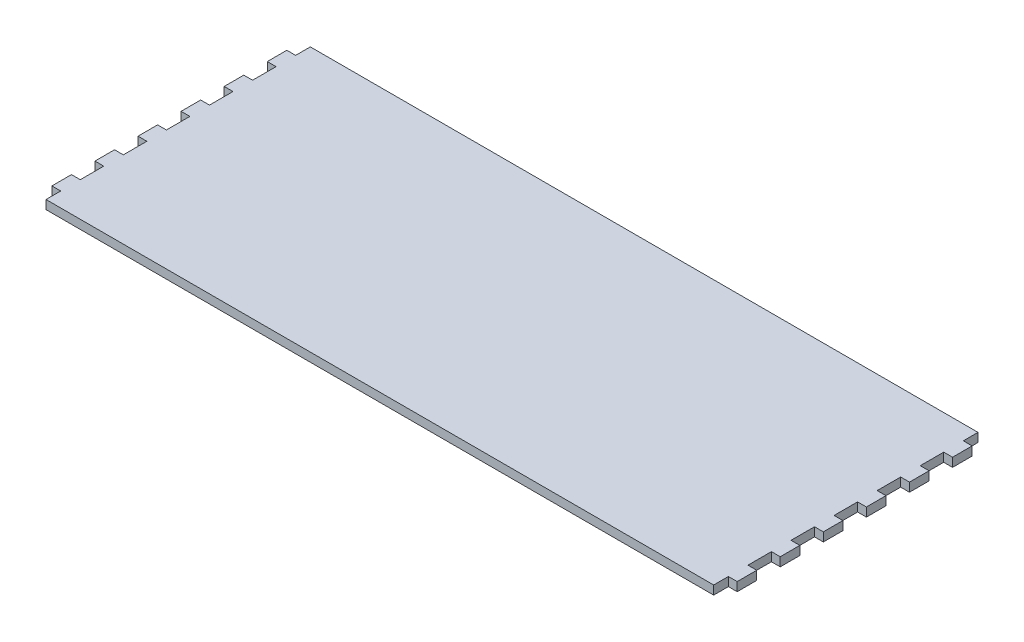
from build123d import *

# Parameters (mm, degrees)
SKETCH1_W           = 682
SKETCH1_H           = 270
BOSS_EXTRUDE1_DEPTH = 9
SKETCH3_W           = 9
SKETCH3_H           = 20
BOSS_EXTRUDE2_DEPTH = 9


with BuildPart() as part:
    # Sketch1 → Boss-Extrude1 (new body)
    with BuildSketch(Plane(origin=(0, 0, 0), x_dir=(1, 0, 0), z_dir=(0, 1, 0))):
        Rectangle(SKETCH1_W, SKETCH1_H)
    extrude(amount=BOSS_EXTRUDE1_DEPTH)

    # Sketch3 → Boss-Extrude2 (add)
    with BuildSketch(Plane(origin=(0, 9, 0), x_dir=(1, 0, 0), z_dir=(0, 1, 0))):
        with Locations((-345.5, -110)):
            Rectangle(SKETCH3_W, SKETCH3_H)
        with Locations((-345.5, -66)):
            Rectangle(SKETCH3_W, SKETCH3_H)
        with Locations((-345.5, -22)):
            Rectangle(SKETCH3_W, SKETCH3_H)
        with Locations((-345.5, 22)):
            Rectangle(SKETCH3_W, SKETCH3_H)
        with Locations((-345.5, 66)):
            Rectangle(SKETCH3_W, SKETCH3_H)
        with Locations((-345.5, 110)):
            Rectangle(SKETCH3_W, SKETCH3_H)
        with Locations((345.5, -110)):
            Rectangle(SKETCH3_W, SKETCH3_H)
        with Locations((345.5, -66)):
            Rectangle(SKETCH3_W, SKETCH3_H)
        with Locations((345.5, -22)):
            Rectangle(SKETCH3_W, SKETCH3_H)
        with Locations((345.5, 22)):
            Rectangle(SKETCH3_W, SKETCH3_H)
        with Locations((345.5, 66)):
            Rectangle(SKETCH3_W, SKETCH3_H)
        with Locations((345.5, 110)):
            Rectangle(SKETCH3_W, SKETCH3_H)
    extrude(amount=-BOSS_EXTRUDE2_DEPTH)


solid = part.part
